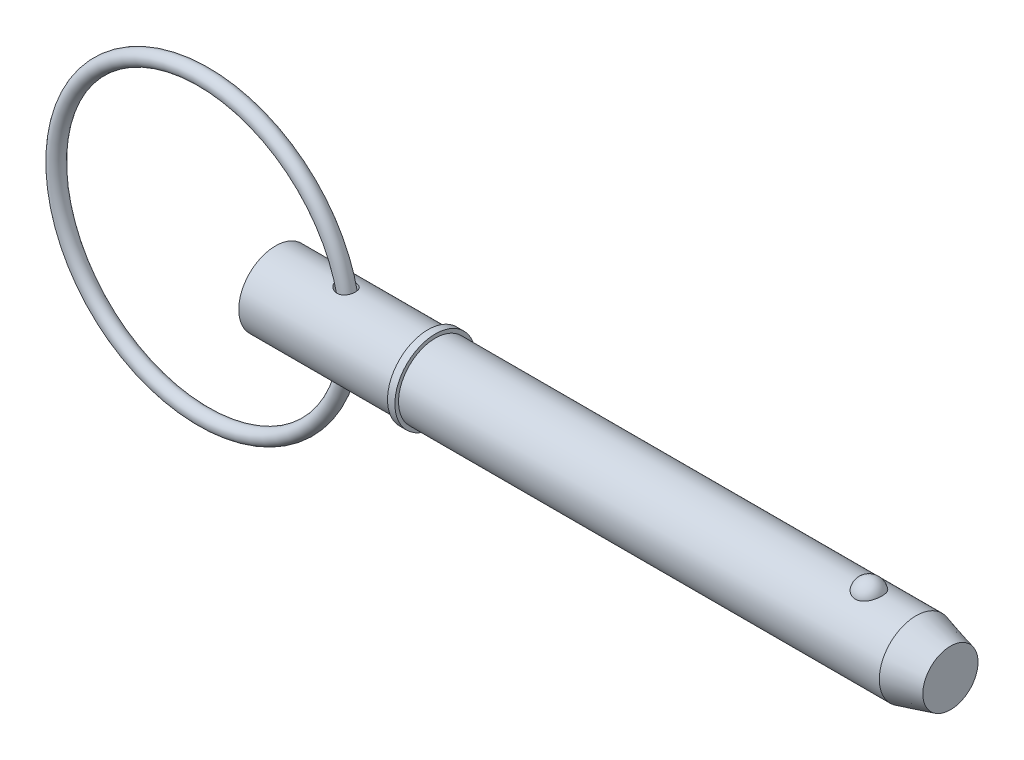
ISO-10303-21;
HEADER;
FILE_DESCRIPTION(('STEP AP214'),'2;1');
FILE_NAME('part.step','',(''),(''),'','','');
FILE_SCHEMA(('AUTOMOTIVE_DESIGN { 1 0 10303 214 1 1 1 1 }'));
ENDSEC;
DATA;
#1=APPLICATION_CONTEXT('core data for automotive mechanical design processes');
#2=APPLICATION_PROTOCOL_DEFINITION('international standard','automotive_design',2000,#1);
#3=PRODUCT_CONTEXT('',#1,'mechanical');
#4=PRODUCT('Part','Part','',(#3));
#5=PRODUCT_RELATED_PRODUCT_CATEGORY('part','',(#4));
#6=PRODUCT_DEFINITION_FORMATION('','',#4);
#7=PRODUCT_DEFINITION_CONTEXT('part definition',#1,'design');
#8=PRODUCT_DEFINITION('design','',#6,#7);
#9=PRODUCT_DEFINITION_SHAPE('','',#8);
#10=(LENGTH_UNIT() NAMED_UNIT(*) SI_UNIT(.MILLI.,.METRE.));
#11=(NAMED_UNIT(*) PLANE_ANGLE_UNIT() SI_UNIT($,.RADIAN.));
#12=(NAMED_UNIT(*) SI_UNIT($,.STERADIAN.) SOLID_ANGLE_UNIT());
#13=UNCERTAINTY_MEASURE_WITH_UNIT(LENGTH_MEASURE(1.E-05),#10,'distance_accuracy_value','');
#14=(GEOMETRIC_REPRESENTATION_CONTEXT(3) GLOBAL_UNCERTAINTY_ASSIGNED_CONTEXT((#13)) GLOBAL_UNIT_ASSIGNED_CONTEXT((#10,
#11,#12)) REPRESENTATION_CONTEXT('',''));
#15=CARTESIAN_POINT('',(0.,0.,0.));
#16=DIRECTION('',(0.,0.,1.));
#17=DIRECTION('',(1.,0.,0.));
#18=AXIS2_PLACEMENT_3D('',#15,#16,#17);
#19=CARTESIAN_POINT('',(-10.8860601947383,0.,0.));
#20=DIRECTION('',(0.,0.,1.));
#21=DIRECTION('',(1.,0.,0.));
#22=AXIS2_PLACEMENT_3D('',#19,#20,#21);
#23=TOROIDAL_SURFACE('',#22,22.225,1.111);
#24=CARTESIAN_POINT('',(12.4499398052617,0.,0.));
#25=VERTEX_POINT('',#24);
#26=VERTEX_LOOP('',#25);
#27=FACE_BOUND('',#26,.T.);
#28=ADVANCED_FACE('P0_F12',(#27),#23,.T.);
#29=CLOSED_SHELL('',(#28));
#30=MANIFOLD_SOLID_BREP('P0_B1',#29);
#31=CARTESIAN_POINT('',(0.,0.,0.));
#32=DIRECTION('',(1.,0.,0.));
#33=DIRECTION('',(0.,0.,-1.));
#34=AXIS2_PLACEMENT_3D('',#31,#32,#33);
#35=CYLINDRICAL_SURFACE('',#34,5.555);
#36=CARTESIAN_POINT('',(9.73108588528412,5.4531967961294,-1.05861687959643));
#37=CARTESIAN_POINT('',(9.79852417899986,5.4428857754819,-1.11173367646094));
#38=CARTESIAN_POINT('',(9.8705426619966,5.43287373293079,-1.15917228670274));
#39=CARTESIAN_POINT('',(10.0216706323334,5.41463354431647,-1.24159548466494));
#40=CARTESIAN_POINT('',(10.100788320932,5.40640749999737,-1.27656543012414));
#41=CARTESIAN_POINT('',(10.2640671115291,5.39277501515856,-1.33298568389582));
#42=CARTESIAN_POINT('',(10.3482338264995,5.38737178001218,-1.35442062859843));
#43=CARTESIAN_POINT('',(10.5191189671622,5.38018930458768,-1.38268153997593));
#44=CARTESIAN_POINT('',(10.6058357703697,5.37840780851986,-1.38951660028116));
#45=CARTESIAN_POINT('',(10.7759121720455,5.37883071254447,-1.38787777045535));
#46=CARTESIAN_POINT('',(10.8592768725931,5.38088957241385,-1.37996287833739));
#47=CARTESIAN_POINT('',(11.0231742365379,5.38856355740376,-1.34968531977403));
#48=CARTESIAN_POINT('',(11.1037078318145,5.39417750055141,-1.3273274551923));
#49=CARTESIAN_POINT('',(11.2542656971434,5.40784427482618,-1.27044672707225));
#50=CARTESIAN_POINT('',(11.3246325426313,5.41571997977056,-1.23678468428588));
#51=CARTESIAN_POINT('',(11.4584043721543,5.43310849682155,-1.15800564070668));
#52=CARTESIAN_POINT('',(11.5218100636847,5.4426211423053,-1.11288980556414));
#53=CARTESIAN_POINT('',(11.6387006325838,5.4619946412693,-1.01348173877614));
#54=CARTESIAN_POINT('',(11.6923567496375,5.47184490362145,-0.959388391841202));
#55=CARTESIAN_POINT('',(11.7899079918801,5.49098914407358,-0.842935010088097));
#56=CARTESIAN_POINT('',(11.8338027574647,5.50028310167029,-0.780574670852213));
#57=CARTESIAN_POINT('',(11.9111930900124,5.51740919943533,-0.64860577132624));
#58=CARTESIAN_POINT('',(11.944571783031,5.52522454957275,-0.578926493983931));
#59=CARTESIAN_POINT('',(11.9994972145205,5.53842713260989,-0.434834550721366));
#60=CARTESIAN_POINT('',(12.0210434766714,5.54381426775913,-0.360421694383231));
#61=CARTESIAN_POINT('',(12.0519313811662,5.55161917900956,-0.208311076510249));
#62=CARTESIAN_POINT('',(12.0611710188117,5.55401212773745,-0.130591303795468));
#63=CARTESIAN_POINT('',(12.0668974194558,5.55548938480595,0.0253480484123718));
#64=CARTESIAN_POINT('',(12.0633840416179,5.55457365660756,0.10356763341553));
#65=CARTESIAN_POINT('',(12.0436796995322,5.54953010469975,0.258343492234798));
#66=CARTESIAN_POINT('',(12.0274798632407,5.54540003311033,0.334898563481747));
#67=CARTESIAN_POINT('',(11.9827711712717,5.53437033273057,0.48411831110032));
#68=CARTESIAN_POINT('',(11.9542620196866,5.52747063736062,0.556782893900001));
#69=CARTESIAN_POINT('',(11.8856108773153,5.51165296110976,0.696153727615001));
#70=CARTESIAN_POINT('',(11.8454690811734,5.50273501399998,0.762860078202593));
#71=CARTESIAN_POINT('',(11.7545317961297,5.48386724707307,0.888403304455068));
#72=CARTESIAN_POINT('',(11.7037367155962,5.47391746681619,0.947240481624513));
#73=CARTESIAN_POINT('',(11.5931044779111,5.45416351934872,1.05504470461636));
#74=CARTESIAN_POINT('',(11.533318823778,5.44435885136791,1.10406448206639));
#75=CARTESIAN_POINT('',(11.4061321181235,5.42595363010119,1.19123649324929));
#76=CARTESIAN_POINT('',(11.3387321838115,5.41735290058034,1.22939031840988));
#77=CARTESIAN_POINT('',(11.1991395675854,5.4024225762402,1.29341737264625));
#78=CARTESIAN_POINT('',(11.1270175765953,5.39606585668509,1.3194385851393));
#79=CARTESIAN_POINT('',(10.979323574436,5.38614405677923,1.35937634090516));
#80=CARTESIAN_POINT('',(10.9037515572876,5.38257898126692,1.37329286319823));
#81=CARTESIAN_POINT('',(10.7507722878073,5.37854282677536,1.38901730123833));
#82=CARTESIAN_POINT('',(10.6733560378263,5.37809300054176,1.39074204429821));
#83=CARTESIAN_POINT('',(10.5192388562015,5.38029043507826,1.38221411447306));
#84=CARTESIAN_POINT('',(10.4425381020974,5.38293844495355,1.37195854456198));
#85=CARTESIAN_POINT('',(10.2878936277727,5.39116673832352,1.33926960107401));
#86=CARTESIAN_POINT('',(10.2100819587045,5.3968880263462,1.31624874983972));
#87=CARTESIAN_POINT('',(10.0591420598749,5.41064666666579,1.25849276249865));
#88=CARTESIAN_POINT('',(9.98601576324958,5.41868496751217,1.22375282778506));
#89=CARTESIAN_POINT('',(9.84175565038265,5.43675805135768,1.14087469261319));
#90=CARTESIAN_POINT('',(9.77103801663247,5.44688674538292,1.09202994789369));
#91=CARTESIAN_POINT('',(9.6388828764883,5.46759592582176,0.983100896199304));
#92=CARTESIAN_POINT('',(9.57744762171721,5.47817652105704,0.92301387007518));
#93=CARTESIAN_POINT('',(9.46620446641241,5.49850106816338,0.79298413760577));
#94=CARTESIAN_POINT('',(9.4163677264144,5.5082470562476,0.723066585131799));
#95=CARTESIAN_POINT('',(9.33050546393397,5.52566389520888,0.57497392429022));
#96=CARTESIAN_POINT('',(9.2944672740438,5.53333664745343,0.49680647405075));
#97=CARTESIAN_POINT('',(9.2410988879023,5.54491199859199,0.342579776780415));
#98=CARTESIAN_POINT('',(9.22228936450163,5.54910883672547,0.267055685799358));
#99=CARTESIAN_POINT('',(9.19883437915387,5.55436306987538,0.113748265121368));
#100=CARTESIAN_POINT('',(9.19417820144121,5.55542284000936,0.0359666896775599));
#101=CARTESIAN_POINT('',(9.19905385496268,5.55432298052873,-0.111477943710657));
#102=CARTESIAN_POINT('',(9.20724428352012,5.55246769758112,-0.181191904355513));
#103=CARTESIAN_POINT('',(9.23493000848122,5.54630180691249,-0.318223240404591));
#104=CARTESIAN_POINT('',(9.25442702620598,5.54199082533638,-0.385540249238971));
#105=CARTESIAN_POINT('',(9.30387481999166,5.5313474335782,-0.516280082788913));
#106=CARTESIAN_POINT('',(9.33386163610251,5.52500806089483,-0.579688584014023));
#107=CARTESIAN_POINT('',(9.40305503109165,5.51092599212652,-0.701037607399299));
#108=CARTESIAN_POINT('',(9.44225922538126,5.50318365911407,-0.758979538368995));
#109=CARTESIAN_POINT('',(9.52133732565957,5.48833949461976,-0.859230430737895));
#110=CARTESIAN_POINT('',(9.55998996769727,5.48134889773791,-0.90252975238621));
#111=CARTESIAN_POINT('',(9.64209346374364,5.46725903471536,-0.984288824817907));
#112=CARTESIAN_POINT('',(9.68554534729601,5.46015974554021,-1.02274753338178));
#113=CARTESIAN_POINT('',(9.73108588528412,5.4531967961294,-1.05861687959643));
#114=B_SPLINE_CURVE_WITH_KNOTS('',3,(#36,#37,#38,#39,#40,#41,#42,#43,#44,#45,#46,#47,#48,#49,
#50,#51,#52,#53,#54,#55,#56,#57,#58,#59,#60,#61,#62,#63,#64,#65,#66,#67,#68,#69,#70,#71,#72,#73,
#74,#75,#76,#77,#78,#79,#80,#81,#82,#83,#84,#85,#86,#87,#88,#89,#90,#91,#92,#93,#94,#95,#96,#97,
#98,#99,#100,#101,#102,#103,#104,#105,#106,#107,#108,#109,#110,#111,#112,#113),.UNSPECIFIED.,
.T.,.F.,(4,2,2,2,2,2,2,2,2,2,2,2,2,2,2,2,2,2,2,2,2,2,2,2,2,2,2,2,2,2,2,2,2,2,2,2,2,2,4),(0.,
0.259176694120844,0.518656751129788,0.778430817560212,1.03804303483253,1.28801585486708,
1.53790560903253,1.77195750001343,2.00598558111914,2.23539047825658,2.46480382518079,
2.69668356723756,2.9285726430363,3.16237203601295,3.39617401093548,3.63013963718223,
3.86411088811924,4.09807822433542,4.33203659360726,4.56470246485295,4.7973342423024,
5.02704913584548,5.25676442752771,5.48804534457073,5.71938220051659,5.96237360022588,
6.20546461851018,6.46387943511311,6.72235683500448,6.98018450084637,7.23777490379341,
7.47029684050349,7.70264268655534,7.91229396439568,8.12197716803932,8.33238797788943,
8.54274441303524,8.71772674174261,8.89274668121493),.UNSPECIFIED.);
#115=CARTESIAN_POINT('',(9.73108588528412,5.4531967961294,-1.05861687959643));
#116=VERTEX_POINT('',#115);
#117=EDGE_CURVE('P1_E42',#116,#116,#114,.T.);
#118=ORIENTED_EDGE('',*,*,#117,.T.);
#119=EDGE_LOOP('',(#118));
#120=FACE_BOUND('',#119,.T.);
#121=CARTESIAN_POINT('',(0.,0.,0.));
#122=DIRECTION('',(1.,0.,0.));
#123=DIRECTION('',(0.,0.,-1.));
#124=AXIS2_PLACEMENT_3D('',#121,#122,#123);
#125=CIRCLE('',#124,5.555);
#126=CARTESIAN_POINT('',(0.,0.,-5.555));
#127=VERTEX_POINT('',#126);
#128=EDGE_CURVE('P1_E9',#127,#127,#125,.T.);
#129=ORIENTED_EDGE('',*,*,#128,.T.);
#130=EDGE_LOOP('',(#129));
#131=FACE_BOUND('',#130,.T.);
#132=CARTESIAN_POINT('',(23.019,0.,0.));
#133=DIRECTION('',(1.,0.,0.));
#134=DIRECTION('',(0.,0.,-1.));
#135=AXIS2_PLACEMENT_3D('',#132,#133,#134);
#136=CIRCLE('',#135,5.555);
#137=CARTESIAN_POINT('',(23.019,0.,-5.555));
#138=VERTEX_POINT('',#137);
#139=EDGE_CURVE('P1_E25',#138,#138,#136,.T.);
#140=ORIENTED_EDGE('',*,*,#139,.F.);
#141=EDGE_LOOP('',(#140));
#142=FACE_BOUND('',#141,.T.);
#143=CARTESIAN_POINT('',(9.73108588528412,-5.4531967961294,-1.05861687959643));
#144=CARTESIAN_POINT('',(9.66821110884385,-5.46281068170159,-1.00909184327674));
#145=CARTESIAN_POINT('',(9.60927221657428,-5.47269103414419,-0.954597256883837));
#146=CARTESIAN_POINT('',(9.50103698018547,-5.49196271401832,-0.836622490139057));
#147=CARTESIAN_POINT('',(9.45174193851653,-5.50135397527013,-0.77314109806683));
#148=CARTESIAN_POINT('',(9.36449982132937,-5.51864538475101,-0.638139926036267));
#149=CARTESIAN_POINT('',(9.32660692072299,-5.52653835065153,-0.566583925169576));
#150=CARTESIAN_POINT('',(9.26443740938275,-5.53978685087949,-0.417563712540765));
#151=CARTESIAN_POINT('',(9.24015003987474,-5.54514438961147,-0.34010422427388));
#152=CARTESIAN_POINT('',(9.20806696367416,-5.55228040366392,-0.18838925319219));
#153=CARTESIAN_POINT('',(9.19907227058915,-5.55431849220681,-0.114399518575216));
#154=CARTESIAN_POINT('',(9.19432225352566,-5.55539069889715,0.0340148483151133));
#155=CARTESIAN_POINT('',(9.19856204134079,-5.55442592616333,0.108439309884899));
#156=CARTESIAN_POINT('',(9.21926816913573,-5.54978420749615,0.250226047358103));
#157=CARTESIAN_POINT('',(9.2348766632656,-5.54629766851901,0.31772275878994));
#158=CARTESIAN_POINT('',(9.27656619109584,-5.53719805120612,0.449233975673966));
#159=CARTESIAN_POINT('',(9.3026486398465,-5.53158468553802,0.513248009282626));
#160=CARTESIAN_POINT('',(9.36540111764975,-5.51852259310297,0.63880901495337));
#161=CARTESIAN_POINT('',(9.40244578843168,-5.51101059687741,0.700161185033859));
#162=CARTESIAN_POINT('',(9.48531033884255,-5.49498546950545,0.816463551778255));
#163=CARTESIAN_POINT('',(9.5311337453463,-5.48647193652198,0.871411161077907));
#164=CARTESIAN_POINT('',(9.63549825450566,-5.46826315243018,0.979510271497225));
#165=CARTESIAN_POINT('',(9.69487291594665,-5.4585383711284,1.03185240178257));
#166=CARTESIAN_POINT('',(9.82107706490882,-5.43973797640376,1.12677509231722));
#167=CARTESIAN_POINT('',(9.8879103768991,-5.43066269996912,1.16935061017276));
#168=CARTESIAN_POINT('',(10.033391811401,-5.41336505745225,1.24708757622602));
#169=CARTESIAN_POINT('',(10.1125613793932,-5.40528106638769,1.28130933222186));
#170=CARTESIAN_POINT('',(10.2757060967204,-5.39196874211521,1.3362270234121));
#171=CARTESIAN_POINT('',(10.3596813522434,-5.38674047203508,1.35692265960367));
#172=CARTESIAN_POINT('',(10.5297702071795,-5.37991196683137,1.38375156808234));
#173=CARTESIAN_POINT('',(10.6158742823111,-5.37829778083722,1.38994084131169));
#174=CARTESIAN_POINT('',(10.7878226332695,-5.3790107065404,1.38718250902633));
#175=CARTESIAN_POINT('',(10.8736670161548,-5.38133587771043,1.37824235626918));
#176=CARTESIAN_POINT('',(11.0366214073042,-5.38945418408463,1.34612618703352));
#177=CARTESIAN_POINT('',(11.1139351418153,-5.39501006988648,1.32392147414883));
#178=CARTESIAN_POINT('',(11.2633246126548,-5.40877222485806,1.26652021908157));
#179=CARTESIAN_POINT('',(11.3354015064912,-5.4169779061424,1.23132655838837));
#180=CARTESIAN_POINT('',(11.4690899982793,-5.43466078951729,1.15069817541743));
#181=CARTESIAN_POINT('',(11.5310200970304,-5.4440673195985,1.10577441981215));
#182=CARTESIAN_POINT('',(11.6463540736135,-5.46335537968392,1.0061512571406));
#183=CARTESIAN_POINT('',(11.6997580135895,-5.47323690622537,0.951451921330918));
#184=CARTESIAN_POINT('',(11.7967319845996,-5.49239864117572,0.833747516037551));
#185=CARTESIAN_POINT('',(11.8402908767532,-5.50167816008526,0.770733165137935));
#186=CARTESIAN_POINT('',(11.9164538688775,-5.518621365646,0.638202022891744));
#187=CARTESIAN_POINT('',(11.9490573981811,-5.52628496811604,0.568684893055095));
#188=CARTESIAN_POINT('',(12.0028717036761,-5.53925911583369,0.424207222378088));
#189=CARTESIAN_POINT('',(12.023941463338,-5.54454040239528,0.349191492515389));
#190=CARTESIAN_POINT('',(12.053591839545,-5.55204602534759,0.196582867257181));
#191=CARTESIAN_POINT('',(12.0621722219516,-5.55427030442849,0.118989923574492));
#192=CARTESIAN_POINT('',(12.0666512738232,-5.55542602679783,-0.0368468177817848));
#193=CARTESIAN_POINT('',(12.0625074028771,-5.55434642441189,-0.115091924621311));
#194=CARTESIAN_POINT('',(12.0415418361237,-5.54898613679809,-0.269753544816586));
#195=CARTESIAN_POINT('',(12.0247199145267,-5.54470539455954,-0.346170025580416));
#196=CARTESIAN_POINT('',(11.9787920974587,-5.53340452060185,-0.495008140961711));
#197=CARTESIAN_POINT('',(11.9496857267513,-5.52638428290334,-0.56742962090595));
#198=CARTESIAN_POINT('',(11.8798787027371,-5.51036911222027,-0.706216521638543));
#199=CARTESIAN_POINT('',(11.8391779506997,-5.50137416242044,-0.772581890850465));
#200=CARTESIAN_POINT('',(11.7472553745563,-5.48242167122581,-0.89724716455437));
#201=CARTESIAN_POINT('',(11.6960515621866,-5.47246579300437,-0.955560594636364));
#202=CARTESIAN_POINT('',(11.5843994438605,-5.45270071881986,-1.06256643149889));
#203=CARTESIAN_POINT('',(11.5239521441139,-5.44289150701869,-1.11125988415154));
#204=CARTESIAN_POINT('',(11.396157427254,-5.42463941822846,-1.19717500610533));
#205=CARTESIAN_POINT('',(11.3288903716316,-5.41618309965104,-1.23451335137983));
#206=CARTESIAN_POINT('',(11.1888557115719,-5.40145691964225,-1.29743539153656));
#207=CARTESIAN_POINT('',(11.1160887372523,-5.39518680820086,-1.32302043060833));
#208=CARTESIAN_POINT('',(10.9677009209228,-5.38553131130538,-1.36179181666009));
#209=CARTESIAN_POINT('',(10.8921036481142,-5.3821260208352,-1.3750637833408));
#210=CARTESIAN_POINT('',(10.7396925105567,-5.37842027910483,-1.38948741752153));
#211=CARTESIAN_POINT('',(10.6628784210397,-5.37812040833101,-1.39063681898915));
#212=CARTESIAN_POINT('',(10.5077947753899,-5.38059635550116,-1.38102577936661));
#213=CARTESIAN_POINT('',(10.4295489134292,-5.3834629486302,-1.36991384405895));
#214=CARTESIAN_POINT('',(10.2758428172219,-5.3920092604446,-1.33587599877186));
#215=CARTESIAN_POINT('',(10.2003829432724,-5.39768934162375,-1.3129485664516));
#216=CARTESIAN_POINT('',(10.0559381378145,-5.41102817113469,-1.25682313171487));
#217=CARTESIAN_POINT('',(9.98683368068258,-5.41862962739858,-1.22391777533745));
#218=CARTESIAN_POINT('',(9.85432617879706,-5.43513913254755,-1.14838146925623));
#219=CARTESIAN_POINT('',(9.79092361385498,-5.44404729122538,-1.1057497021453));
#220=CARTESIAN_POINT('',(9.73108588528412,-5.4531967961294,-1.05861687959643));
#221=B_SPLINE_CURVE_WITH_KNOTS('',3,(#143,#144,#145,#146,#147,#148,#149,#150,#151,#152,#153,
#154,#155,#156,#157,#158,#159,#160,#161,#162,#163,#164,#165,#166,#167,#168,#169,#170,#171,#172,
#173,#174,#175,#176,#177,#178,#179,#180,#181,#182,#183,#184,#185,#186,#187,#188,#189,#190,#191,
#192,#193,#194,#195,#196,#197,#198,#199,#200,#201,#202,#203,#204,#205,#206,#207,#208,#209,#210,
#211,#212,#213,#214,#215,#216,#217,#218,#219,#220),.UNSPECIFIED.,.T.,.F.,(4,2,2,2,2,2,2,2,2,2,2,
2,2,2,2,2,2,2,2,2,2,2,2,2,2,2,2,2,2,2,2,2,2,2,2,2,2,2,4),(0.,0.241596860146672,
0.483226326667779,0.725986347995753,0.968554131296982,1.19103755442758,1.41343881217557,
1.62059806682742,1.82778531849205,2.04308674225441,2.25847484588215,2.4967195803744,
2.73508704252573,2.99374644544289,3.25241156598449,3.51007646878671,3.76761448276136,
4.00827541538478,4.24888299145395,4.47904430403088,4.70920393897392,4.93962269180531,
5.17005344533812,5.4032419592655,5.63643484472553,5.87040820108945,6.10438572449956,
6.33837230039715,6.57236086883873,6.80595147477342,7.03951667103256,7.27059385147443,
7.50164459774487,7.73107640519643,7.96055109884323,8.19677907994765,8.43303750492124,
8.66294515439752,8.8928721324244),.UNSPECIFIED.);
#222=CARTESIAN_POINT('',(9.73108588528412,-5.4531967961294,-1.05861687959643));
#223=VERTEX_POINT('',#222);
#224=EDGE_CURVE('P1_E17',#223,#223,#221,.T.);
#225=ORIENTED_EDGE('',*,*,#224,.T.);
#226=EDGE_LOOP('',(#225));
#227=FACE_BOUND('',#226,.T.);
#228=ADVANCED_FACE('P1_F13',(#120,#131,#142,#227),#35,.T.);
#229=CARTESIAN_POINT('',(0.,0.,0.));
#230=DIRECTION('',(1.,0.,0.));
#231=DIRECTION('',(0.,0.,-1.));
#232=AXIS2_PLACEMENT_3D('',#229,#230,#231);
#233=CYLINDRICAL_SURFACE('',#232,5.555);
#234=CARTESIAN_POINT('',(96.7171144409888,0.,0.));
#235=DIRECTION('',(1.,0.,0.));
#236=DIRECTION('',(0.,0.,-1.));
#237=AXIS2_PLACEMENT_3D('',#234,#235,#236);
#238=CIRCLE('',#237,5.555);
#239=CARTESIAN_POINT('',(96.7171144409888,0.,-5.555));
#240=VERTEX_POINT('',#239);
#241=EDGE_CURVE('P1_E99',#240,#240,#238,.T.);
#242=ORIENTED_EDGE('',*,*,#241,.F.);
#243=EDGE_LOOP('',(#242));
#244=FACE_BOUND('',#243,.T.);
#245=CARTESIAN_POINT('',(24.13,0.,0.));
#246=DIRECTION('',(1.,0.,0.));
#247=DIRECTION('',(0.,0.,-1.));
#248=AXIS2_PLACEMENT_3D('',#245,#246,#247);
#249=CIRCLE('',#248,5.555);
#250=CARTESIAN_POINT('',(24.13,0.,-5.555));
#251=VERTEX_POINT('',#250);
#252=EDGE_CURVE('P1_E96',#251,#251,#249,.T.);
#253=ORIENTED_EDGE('',*,*,#252,.T.);
#254=EDGE_LOOP('',(#253));
#255=FACE_BOUND('',#254,.T.);
#256=CARTESIAN_POINT('',(89.5986264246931,5.16741224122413,2.03859650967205));
#257=CARTESIAN_POINT('',(89.4929492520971,5.16740893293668,2.03859990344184));
#258=CARTESIAN_POINT('',(89.38729894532,5.17079470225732,2.03008306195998));
#259=CARTESIAN_POINT('',(89.1791419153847,5.18392795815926,1.9963072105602));
#260=CARTESIAN_POINT('',(89.0766344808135,5.19367399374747,1.9710520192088));
#261=CARTESIAN_POINT('',(88.8777710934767,5.21839168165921,1.90463997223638));
#262=CARTESIAN_POINT('',(88.7814064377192,5.23335573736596,1.86350622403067));
#263=CARTESIAN_POINT('',(88.5970804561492,5.26688076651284,1.76652592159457));
#264=CARTESIAN_POINT('',(88.5091207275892,5.28544242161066,1.71067657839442));
#265=CARTESIAN_POINT('',(88.3412654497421,5.32479845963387,1.58399959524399));
#266=CARTESIAN_POINT('',(88.2616656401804,5.34564089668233,1.51279545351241));
#267=CARTESIAN_POINT('',(88.1151290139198,5.38697258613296,1.35828584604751));
#268=CARTESIAN_POINT('',(88.048194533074,5.40746177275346,1.27497815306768));
#269=CARTESIAN_POINT('',(87.9256103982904,5.44694508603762,1.09440293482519));
#270=CARTESIAN_POINT('',(87.8705989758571,5.46583143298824,0.996677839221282));
#271=CARTESIAN_POINT('',(87.7769376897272,5.49908030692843,0.792961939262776));
#272=CARTESIAN_POINT('',(87.7382894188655,5.513442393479,0.686970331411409));
#273=CARTESIAN_POINT('',(87.6776807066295,5.536358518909,0.468019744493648));
#274=CARTESIAN_POINT('',(87.6559725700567,5.54482455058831,0.354981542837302));
#275=CARTESIAN_POINT('',(87.6306362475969,5.55473324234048,0.126595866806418));
#276=CARTESIAN_POINT('',(87.6270077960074,5.55617600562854,0.0112484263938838));
#277=CARTESIAN_POINT('',(87.6378817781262,5.55189984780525,-0.218011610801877));
#278=CARTESIAN_POINT('',(87.6523151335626,5.54620821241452,-0.331928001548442));
#279=CARTESIAN_POINT('',(87.698903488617,5.52828920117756,-0.555544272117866));
#280=CARTESIAN_POINT('',(87.7310588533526,5.5160616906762,-0.665244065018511));
#281=CARTESIAN_POINT('',(87.8124883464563,5.48630779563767,-0.877469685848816));
#282=CARTESIAN_POINT('',(87.8617816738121,5.4687754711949,-0.979987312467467));
#283=CARTESIAN_POINT('',(87.9764785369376,5.43024700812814,-1.17486975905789));
#284=CARTESIAN_POINT('',(88.0418831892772,5.4092506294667,-1.26723387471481));
#285=CARTESIAN_POINT('',(88.1875712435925,5.36600927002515,-1.43940133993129));
#286=CARTESIAN_POINT('',(88.2678859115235,5.34376173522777,-1.5191776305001));
#287=CARTESIAN_POINT('',(88.4414520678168,5.30057971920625,-1.66360338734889));
#288=CARTESIAN_POINT('',(88.534702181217,5.27964509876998,-1.72825445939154));
#289=CARTESIAN_POINT('',(88.7293939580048,5.24205250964,-1.8390947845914));
#290=CARTESIAN_POINT('',(88.8305900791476,5.22530519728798,-1.88568407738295));
#291=CARTESIAN_POINT('',(89.0401552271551,5.19750919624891,-1.96100802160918));
#292=CARTESIAN_POINT('',(89.1485215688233,5.18645838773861,-1.98974931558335));
#293=CARTESIAN_POINT('',(89.3634989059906,5.17184410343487,-2.02742262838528));
#294=CARTESIAN_POINT('',(89.469925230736,5.16793282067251,-2.0372760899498));
#295=CARTESIAN_POINT('',(89.6829925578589,5.1669899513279,-2.03966777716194));
#296=CARTESIAN_POINT('',(89.7896335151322,5.16995704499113,-2.03220932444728));
#297=CARTESIAN_POINT('',(89.9967730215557,5.18222383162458,-2.0007117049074));
#298=CARTESIAN_POINT('',(90.0973599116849,5.19133213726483,-1.97717337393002));
#299=CARTESIAN_POINT('',(90.2930141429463,5.21467637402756,-1.91475248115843));
#300=CARTESIAN_POINT('',(90.3880810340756,5.22891272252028,-1.87586867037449));
#301=CARTESIAN_POINT('',(90.5723711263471,5.26137066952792,-1.78282713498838));
#302=CARTESIAN_POINT('',(90.6614190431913,5.27967329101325,-1.7283512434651));
#303=CARTESIAN_POINT('',(90.8292880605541,5.31817411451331,-1.60597483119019));
#304=CARTESIAN_POINT('',(90.9081068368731,5.33837274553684,-1.53807126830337));
#305=CARTESIAN_POINT('',(91.0575156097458,5.37968287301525,-1.38688970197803));
#306=CARTESIAN_POINT('',(91.1275058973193,5.40079011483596,-1.30301744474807));
#307=CARTESIAN_POINT('',(91.2530125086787,5.44074401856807,-1.12458170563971));
#308=CARTESIAN_POINT('',(91.3085262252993,5.4595902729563,-1.03001630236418));
#309=CARTESIAN_POINT('',(91.4055507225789,5.49369849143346,-0.829439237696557));
#310=CARTESIAN_POINT('',(91.4465483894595,5.50882422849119,-0.723155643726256));
#311=CARTESIAN_POINT('',(91.5111250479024,5.53310911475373,-0.504772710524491));
#312=CARTESIAN_POINT('',(91.5347036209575,5.54226812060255,-0.39267323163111));
#313=CARTESIAN_POINT('',(91.564013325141,5.55370358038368,-0.165459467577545));
#314=CARTESIAN_POINT('',(91.5696884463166,5.55595843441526,-0.0503368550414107));
#315=CARTESIAN_POINT('',(91.562916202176,5.55329317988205,0.179288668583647));
#316=CARTESIAN_POINT('',(91.5504690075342,5.54837313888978,0.293791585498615));
#317=CARTESIAN_POINT('',(91.5077798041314,5.53189037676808,0.518526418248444));
#318=CARTESIAN_POINT('',(91.477598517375,5.5203503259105,0.628771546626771));
#319=CARTESIAN_POINT('',(91.4000962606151,5.49182453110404,0.84231815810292));
#320=CARTESIAN_POINT('',(91.3527743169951,5.47483847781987,0.945619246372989));
#321=CARTESIAN_POINT('',(91.2417204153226,5.43710633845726,1.14281571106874));
#322=CARTESIAN_POINT('',(91.1779215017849,5.41634501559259,1.23667048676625));
#323=CARTESIAN_POINT('',(91.0353577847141,5.37334572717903,1.4118524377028));
#324=CARTESIAN_POINT('',(90.9565932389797,5.35110778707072,1.49317982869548));
#325=CARTESIAN_POINT('',(90.7864234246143,5.30779474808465,1.64049162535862));
#326=CARTESIAN_POINT('',(90.6951002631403,5.28671324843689,1.70656877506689));
#327=CARTESIAN_POINT('',(90.5017390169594,5.2480485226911,1.82201372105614));
#328=CARTESIAN_POINT('',(90.3997005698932,5.23046541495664,1.87138095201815));
#329=CARTESIAN_POINT('',(90.1836187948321,5.20042692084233,1.95335298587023));
#330=CARTESIAN_POINT('',(90.0692602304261,5.18820192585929,1.98521734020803));
#331=CARTESIAN_POINT('',(89.8361307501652,5.17169804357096,2.02783294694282));
#332=CARTESIAN_POINT('',(89.7173616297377,5.16741595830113,2.03859269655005));
#333=CARTESIAN_POINT('',(89.5986264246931,5.16741224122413,2.03859650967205));
#334=B_SPLINE_CURVE_WITH_KNOTS('',3,(#256,#257,#258,#259,#260,#261,#262,#263,#264,#265,#266,
#267,#268,#269,#270,#271,#272,#273,#274,#275,#276,#277,#278,#279,#280,#281,#282,#283,#284,#285,
#286,#287,#288,#289,#290,#291,#292,#293,#294,#295,#296,#297,#298,#299,#300,#301,#302,#303,#304,
#305,#306,#307,#308,#309,#310,#311,#312,#313,#314,#315,#316,#317,#318,#319,#320,#321,#322,#323,
#324,#325,#326,#327,#328,#329,#330,#331,#332,#333),.UNSPECIFIED.,.T.,.F.,(4,2,2,2,2,2,2,2,2,2,2,
2,2,2,2,2,2,2,2,2,2,2,2,2,2,2,2,2,2,2,2,2,2,2,2,2,2,2,4),(0.,0.316595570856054,
0.633118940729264,0.949183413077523,1.26530783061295,1.59030762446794,1.91536729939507,
2.25495824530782,2.59458224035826,2.93917283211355,3.28375835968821,3.62703002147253,
3.97030875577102,4.3139732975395,4.65766166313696,5.00207904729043,5.3464598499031,
5.68270547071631,6.0188258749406,6.33808403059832,6.65728093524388,6.96696376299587,
7.27667180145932,7.59321535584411,7.90983070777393,8.24210387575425,8.57443684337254,
8.91755896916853,9.26068933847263,9.60489211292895,9.949091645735,10.2921194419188,
10.6351667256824,10.9796305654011,11.324088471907,11.666392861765,12.0087088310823,
12.3645679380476,12.7202837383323),.UNSPECIFIED.);
#335=CARTESIAN_POINT('',(89.5986264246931,5.16741224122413,2.03859650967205));
#336=VERTEX_POINT('',#335);
#337=EDGE_CURVE('P1_E34',#336,#336,#334,.T.);
#338=ORIENTED_EDGE('',*,*,#337,.T.);
#339=EDGE_LOOP('',(#338));
#340=FACE_BOUND('',#339,.T.);
#341=ADVANCED_FACE('P1_F46',(#244,#255,#340),#233,.T.);
#342=CARTESIAN_POINT('',(0.,0.,0.));
#343=DIRECTION('',(-1.,0.,0.));
#344=DIRECTION('',(0.,0.,1.));
#345=AXIS2_PLACEMENT_3D('',#342,#343,#344);
#346=PLANE('',#345);
#347=ORIENTED_EDGE('',*,*,#128,.F.);
#348=EDGE_LOOP('',(#347));
#349=FACE_BOUND('',#348,.T.);
#350=ADVANCED_FACE('P1_F15',(#349),#346,.T.);
#351=CARTESIAN_POINT('',(23.019,5.555,0.));
#352=DIRECTION('',(-1.,0.,0.));
#353=DIRECTION('',(0.,0.,1.));
#354=AXIS2_PLACEMENT_3D('',#351,#352,#353);
#355=PLANE('',#354);
#356=ORIENTED_EDGE('',*,*,#139,.T.);
#357=EDGE_LOOP('',(#356));
#358=FACE_BOUND('',#357,.T.);
#359=CARTESIAN_POINT('',(23.019,0.,0.));
#360=DIRECTION('',(1.,0.,0.));
#361=DIRECTION('',(0.,0.,-1.));
#362=AXIS2_PLACEMENT_3D('',#359,#360,#361);
#363=CIRCLE('',#362,6.1105);
#364=CARTESIAN_POINT('',(23.019,0.,-6.1105));
#365=VERTEX_POINT('',#364);
#366=EDGE_CURVE('P1_E30',#365,#365,#363,.T.);
#367=ORIENTED_EDGE('',*,*,#366,.F.);
#368=EDGE_LOOP('',(#367));
#369=FACE_BOUND('',#368,.T.);
#370=ADVANCED_FACE('P1_F81',(#358,#369),#355,.T.);
#371=CARTESIAN_POINT('',(0.,0.,0.));
#372=DIRECTION('',(1.,0.,0.));
#373=DIRECTION('',(0.,0.,-1.));
#374=AXIS2_PLACEMENT_3D('',#371,#372,#373);
#375=CYLINDRICAL_SURFACE('',#374,6.1105);
#376=ORIENTED_EDGE('',*,*,#366,.T.);
#377=EDGE_LOOP('',(#376));
#378=FACE_BOUND('',#377,.T.);
#379=CARTESIAN_POINT('',(24.13,0.,0.));
#380=DIRECTION('',(1.,0.,0.));
#381=DIRECTION('',(0.,0.,-1.));
#382=AXIS2_PLACEMENT_3D('',#379,#380,#381);
#383=CIRCLE('',#382,6.1105);
#384=CARTESIAN_POINT('',(24.13,0.,-6.1105));
#385=VERTEX_POINT('',#384);
#386=EDGE_CURVE('P1_E95',#385,#385,#383,.T.);
#387=ORIENTED_EDGE('',*,*,#386,.F.);
#388=EDGE_LOOP('',(#387));
#389=FACE_BOUND('',#388,.T.);
#390=ADVANCED_FACE('P1_F68',(#378,#389),#375,.T.);
#391=CARTESIAN_POINT('',(24.13,6.1105,0.));
#392=DIRECTION('',(1.,0.,0.));
#393=DIRECTION('',(0.,0.,-1.));
#394=AXIS2_PLACEMENT_3D('',#391,#392,#393);
#395=PLANE('',#394);
#396=ORIENTED_EDGE('',*,*,#386,.T.);
#397=EDGE_LOOP('',(#396));
#398=FACE_BOUND('',#397,.T.);
#399=ORIENTED_EDGE('',*,*,#252,.F.);
#400=EDGE_LOOP('',(#399));
#401=FACE_BOUND('',#400,.T.);
#402=ADVANCED_FACE('P1_F62',(#398,#401),#395,.T.);
#403=CARTESIAN_POINT('',(101.9,0.,0.));
#404=DIRECTION('',(-1.,0.,0.));
#405=DIRECTION('',(0.,0.,1.));
#406=AXIS2_PLACEMENT_3D('',#403,#404,#405);
#407=CONICAL_SURFACE('',#406,4.16625000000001,0.26179938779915);
#408=ORIENTED_EDGE('',*,*,#241,.T.);
#409=EDGE_LOOP('',(#408));
#410=FACE_BOUND('',#409,.T.);
#411=CARTESIAN_POINT('',(101.9,0.,0.));
#412=DIRECTION('',(1.,0.,0.));
#413=DIRECTION('',(0.,0.,-1.));
#414=AXIS2_PLACEMENT_3D('',#411,#412,#413);
#415=CIRCLE('',#414,4.16625000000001);
#416=CARTESIAN_POINT('',(101.9,0.,-4.16625000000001));
#417=VERTEX_POINT('',#416);
#418=EDGE_CURVE('P1_E41',#417,#417,#415,.T.);
#419=ORIENTED_EDGE('',*,*,#418,.F.);
#420=EDGE_LOOP('',(#419));
#421=FACE_BOUND('',#420,.T.);
#422=ADVANCED_FACE('P1_F59',(#410,#421),#407,.T.);
#423=CARTESIAN_POINT('',(101.9,4.16625000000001,0.));
#424=DIRECTION('',(1.,0.,0.));
#425=DIRECTION('',(0.,0.,-1.));
#426=AXIS2_PLACEMENT_3D('',#423,#424,#425);
#427=PLANE('',#426);
#428=ORIENTED_EDGE('',*,*,#418,.T.);
#429=EDGE_LOOP('',(#428));
#430=FACE_BOUND('',#429,.T.);
#431=ADVANCED_FACE('P1_F55',(#430),#427,.T.);
#432=CARTESIAN_POINT('',(89.5986264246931,4.9995,0.));
#433=DIRECTION('',(-1.,0.,0.));
#434=DIRECTION('',(0.,1.,0.));
#435=AXIS2_PLACEMENT_3D('',#432,#433,#434);
#436=SPHERICAL_SURFACE('',#435,2.04549999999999);
#437=ORIENTED_EDGE('',*,*,#337,.F.);
#438=EDGE_LOOP('',(#437));
#439=FACE_BOUND('',#438,.T.);
#440=ADVANCED_FACE('P1_F50',(#439),#436,.T.);
#441=CARTESIAN_POINT('',(-10.8860601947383,0.,0.));
#442=DIRECTION('',(0.,0.,1.));
#443=DIRECTION('',(1.,0.,0.));
#444=AXIS2_PLACEMENT_3D('',#441,#442,#443);
#445=TOROIDAL_SURFACE('',#444,22.225,1.38875);
#446=ORIENTED_EDGE('',*,*,#224,.F.);
#447=EDGE_LOOP('',(#446));
#448=FACE_BOUND('',#447,.T.);
#449=ORIENTED_EDGE('',*,*,#117,.F.);
#450=EDGE_LOOP('',(#449));
#451=FACE_BOUND('',#450,.T.);
#452=ADVANCED_FACE('P1_F54',(#448,#451),#445,.F.);
#453=CLOSED_SHELL('',(#228,#341,#350,#370,#390,#402,#422,#431,#440,#452));
#454=MANIFOLD_SOLID_BREP('P1_B1',#453);
#455=ADVANCED_BREP_SHAPE_REPRESENTATION('',(#18,#30,#454),#14);
#456=SHAPE_DEFINITION_REPRESENTATION(#9,#455);
ENDSEC;
END-ISO-10303-21;
